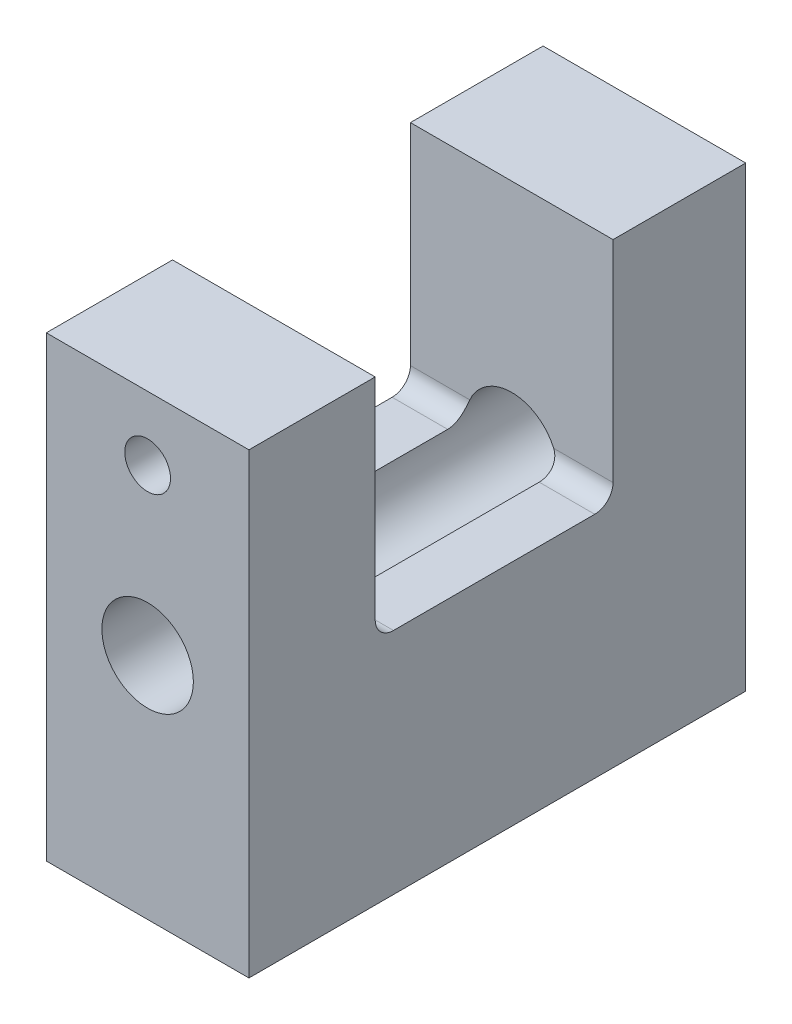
ISO-10303-21;
HEADER;
FILE_DESCRIPTION(('STEP AP214'),'2;1');
FILE_NAME('part.step','',(''),(''),'','','');
FILE_SCHEMA(('AUTOMOTIVE_DESIGN { 1 0 10303 214 1 1 1 1 }'));
ENDSEC;
DATA;
#1=APPLICATION_CONTEXT('core data for automotive mechanical design processes');
#2=APPLICATION_PROTOCOL_DEFINITION('international standard','automotive_design',2000,#1);
#3=PRODUCT_CONTEXT('',#1,'mechanical');
#4=PRODUCT('Part','Part','',(#3));
#5=PRODUCT_RELATED_PRODUCT_CATEGORY('part','',(#4));
#6=PRODUCT_DEFINITION_FORMATION('','',#4);
#7=PRODUCT_DEFINITION_CONTEXT('part definition',#1,'design');
#8=PRODUCT_DEFINITION('design','',#6,#7);
#9=PRODUCT_DEFINITION_SHAPE('','',#8);
#10=(LENGTH_UNIT() NAMED_UNIT(*) SI_UNIT(.MILLI.,.METRE.));
#11=(NAMED_UNIT(*) PLANE_ANGLE_UNIT() SI_UNIT($,.RADIAN.));
#12=(NAMED_UNIT(*) SI_UNIT($,.STERADIAN.) SOLID_ANGLE_UNIT());
#13=UNCERTAINTY_MEASURE_WITH_UNIT(LENGTH_MEASURE(1.E-05),#10,'distance_accuracy_value','');
#14=(GEOMETRIC_REPRESENTATION_CONTEXT(3) GLOBAL_UNCERTAINTY_ASSIGNED_CONTEXT((#13)) GLOBAL_UNIT_ASSIGNED_CONTEXT((#10,
#11,#12)) REPRESENTATION_CONTEXT('',''));
#15=CARTESIAN_POINT('',(0.,0.,0.));
#16=DIRECTION('',(0.,0.,1.));
#17=DIRECTION('',(1.,0.,0.));
#18=AXIS2_PLACEMENT_3D('',#15,#16,#17);
#19=CARTESIAN_POINT('',(-40.,20.,54.3));
#20=DIRECTION('',(0.,-1.,0.));
#21=DIRECTION('',(1.,0.,0.));
#22=AXIS2_PLACEMENT_3D('',#19,#20,#21);
#23=PLANE('',#22);
#24=DIRECTION('',(0.,0.,-1.));
#25=VECTOR('',#24,1.);
#26=CARTESIAN_POINT('',(-17.85,20.,54.3));
#27=LINE('',#26,#25);
#28=CARTESIAN_POINT('',(-17.85,20.,54.3));
#29=VERTEX_POINT('',#28);
#30=CARTESIAN_POINT('',(-17.85,20.,40.5));
#31=VERTEX_POINT('',#30);
#32=EDGE_CURVE('E159',#29,#31,#27,.T.);
#33=ORIENTED_EDGE('',*,*,#32,.T.);
#34=DIRECTION('',(1.,0.,0.));
#35=VECTOR('',#34,1.);
#36=CARTESIAN_POINT('',(-40.,20.,40.5));
#37=LINE('',#36,#35);
#38=CARTESIAN_POINT('',(-40.,20.,40.5));
#39=VERTEX_POINT('',#38);
#40=EDGE_CURVE('E140',#39,#31,#37,.T.);
#41=ORIENTED_EDGE('',*,*,#40,.F.);
#42=DIRECTION('',(0.,0.,-1.));
#43=VECTOR('',#42,1.);
#44=CARTESIAN_POINT('',(-40.,20.,54.3));
#45=LINE('',#44,#43);
#46=CARTESIAN_POINT('',(-40.,20.,54.3));
#47=VERTEX_POINT('',#46);
#48=EDGE_CURVE('E172',#47,#39,#45,.T.);
#49=ORIENTED_EDGE('',*,*,#48,.F.);
#50=DIRECTION('',(-1.,0.,0.));
#51=VECTOR('',#50,1.);
#52=CARTESIAN_POINT('',(-40.,20.,54.3));
#53=LINE('',#52,#51);
#54=EDGE_CURVE('E165',#29,#47,#53,.T.);
#55=ORIENTED_EDGE('',*,*,#54,.F.);
#56=EDGE_LOOP('',(#33,#41,#49,#55));
#57=FACE_BOUND('',#56,.T.);
#58=ADVANCED_FACE('F34',(#57),#23,.F.);
#59=CARTESIAN_POINT('',(-40.,-30.,54.3));
#60=DIRECTION('',(0.,0.,-1.));
#61=DIRECTION('',(-1.,0.,0.));
#62=AXIS2_PLACEMENT_3D('',#59,#60,#61);
#63=PLANE('',#62);
#64=CARTESIAN_POINT('',(-28.925,13.,54.3));
#65=DIRECTION('',(0.,0.,1.));
#66=DIRECTION('',(1.,0.,0.));
#67=AXIS2_PLACEMENT_3D('',#64,#65,#66);
#68=CIRCLE('',#67,2.5);
#69=CARTESIAN_POINT('',(-26.425,13.,54.3));
#70=VERTEX_POINT('',#69);
#71=EDGE_CURVE('E322',#70,#70,#68,.T.);
#72=ORIENTED_EDGE('',*,*,#71,.F.);
#73=EDGE_LOOP('',(#72));
#74=FACE_BOUND('',#73,.T.);
#75=DIRECTION('',(0.,-1.,0.));
#76=VECTOR('',#75,1.);
#77=CARTESIAN_POINT('',(-40.,-30.,54.3));
#78=LINE('',#77,#76);
#79=CARTESIAN_POINT('',(-40.,-30.,54.3));
#80=VERTEX_POINT('',#79);
#81=EDGE_CURVE('E295',#47,#80,#78,.T.);
#82=ORIENTED_EDGE('',*,*,#81,.T.);
#83=DIRECTION('',(1.,0.,0.));
#84=VECTOR('',#83,1.);
#85=CARTESIAN_POINT('',(-40.,-30.,54.3));
#86=LINE('',#85,#84);
#87=CARTESIAN_POINT('',(-17.85,-30.,54.3));
#88=VERTEX_POINT('',#87);
#89=EDGE_CURVE('E291',#80,#88,#86,.T.);
#90=ORIENTED_EDGE('',*,*,#89,.T.);
#91=DIRECTION('',(0.,1.,0.));
#92=VECTOR('',#91,1.);
#93=CARTESIAN_POINT('',(-17.85,-30.,54.3));
#94=LINE('',#93,#92);
#95=EDGE_CURVE('E288',#88,#29,#94,.T.);
#96=ORIENTED_EDGE('',*,*,#95,.T.);
#97=ORIENTED_EDGE('',*,*,#54,.T.);
#98=EDGE_LOOP('',(#82,#90,#96,#97));
#99=FACE_BOUND('',#98,.T.);
#100=CARTESIAN_POINT('',(-28.925,-4.99999999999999,54.3));
#101=DIRECTION('',(0.,0.,1.));
#102=DIRECTION('',(1.,0.,0.));
#103=AXIS2_PLACEMENT_3D('',#100,#101,#102);
#104=CIRCLE('',#103,5.);
#105=CARTESIAN_POINT('',(-23.925,-4.99999999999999,54.3));
#106=VERTEX_POINT('',#105);
#107=EDGE_CURVE('E305',#106,#106,#104,.T.);
#108=ORIENTED_EDGE('',*,*,#107,.F.);
#109=EDGE_LOOP('',(#108));
#110=FACE_BOUND('',#109,.T.);
#111=ADVANCED_FACE('F265',(#74,#99,#110),#63,.F.);
#112=CARTESIAN_POINT('',(-40.,-30.,0.));
#113=DIRECTION('',(0.,0.,-1.));
#114=DIRECTION('',(-1.,0.,0.));
#115=AXIS2_PLACEMENT_3D('',#112,#113,#114);
#116=PLANE('',#115);
#117=CARTESIAN_POINT('',(-28.925,-23.,0.));
#118=DIRECTION('',(0.,0.,-1.));
#119=DIRECTION('',(-1.,0.,0.));
#120=AXIS2_PLACEMENT_3D('',#117,#118,#119);
#121=CIRCLE('',#120,2.5);
#122=CARTESIAN_POINT('',(-31.425,-23.,0.));
#123=VERTEX_POINT('',#122);
#124=EDGE_CURVE('E328',#123,#123,#121,.T.);
#125=ORIENTED_EDGE('',*,*,#124,.F.);
#126=EDGE_LOOP('',(#125));
#127=FACE_BOUND('',#126,.T.);
#128=DIRECTION('',(0.,-1.,0.));
#129=VECTOR('',#128,1.);
#130=CARTESIAN_POINT('',(-40.,-30.,0.));
#131=LINE('',#130,#129);
#132=CARTESIAN_POINT('',(-40.,20.,0.));
#133=VERTEX_POINT('',#132);
#134=CARTESIAN_POINT('',(-40.,-30.,0.));
#135=VERTEX_POINT('',#134);
#136=EDGE_CURVE('E303',#133,#135,#131,.T.);
#137=ORIENTED_EDGE('',*,*,#136,.F.);
#138=DIRECTION('',(-1.,0.,0.));
#139=VECTOR('',#138,1.);
#140=CARTESIAN_POINT('',(-40.,20.,0.));
#141=LINE('',#140,#139);
#142=CARTESIAN_POINT('',(-17.85,20.,0.));
#143=VERTEX_POINT('',#142);
#144=EDGE_CURVE('E285',#143,#133,#141,.T.);
#145=ORIENTED_EDGE('',*,*,#144,.F.);
#146=DIRECTION('',(0.,1.,0.));
#147=VECTOR('',#146,1.);
#148=CARTESIAN_POINT('',(-17.85,-30.,0.));
#149=LINE('',#148,#147);
#150=CARTESIAN_POINT('',(-17.85,-30.,0.));
#151=VERTEX_POINT('',#150);
#152=EDGE_CURVE('E298',#151,#143,#149,.T.);
#153=ORIENTED_EDGE('',*,*,#152,.F.);
#154=DIRECTION('',(1.,0.,0.));
#155=VECTOR('',#154,1.);
#156=CARTESIAN_POINT('',(-40.,-30.,0.));
#157=LINE('',#156,#155);
#158=EDGE_CURVE('E301',#135,#151,#157,.T.);
#159=ORIENTED_EDGE('',*,*,#158,.F.);
#160=EDGE_LOOP('',(#137,#145,#153,#159));
#161=FACE_BOUND('',#160,.T.);
#162=CARTESIAN_POINT('',(-28.925,-4.99999999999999,0.));
#163=DIRECTION('',(0.,0.,1.));
#164=DIRECTION('',(1.,0.,0.));
#165=AXIS2_PLACEMENT_3D('',#162,#163,#164);
#166=CIRCLE('',#165,5.);
#167=CARTESIAN_POINT('',(-23.925,-4.99999999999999,0.));
#168=VERTEX_POINT('',#167);
#169=EDGE_CURVE('E151',#168,#168,#166,.T.);
#170=ORIENTED_EDGE('',*,*,#169,.T.);
#171=EDGE_LOOP('',(#170));
#172=FACE_BOUND('',#171,.T.);
#173=ADVANCED_FACE('F234',(#127,#161,#172),#116,.T.);
#174=CARTESIAN_POINT('',(-40.,-30.,54.3));
#175=DIRECTION('',(1.,0.,0.));
#176=DIRECTION('',(0.,0.,-1.));
#177=AXIS2_PLACEMENT_3D('',#174,#175,#176);
#178=PLANE('',#177);
#179=ORIENTED_EDGE('',*,*,#48,.T.);
#180=DIRECTION('',(0.,-1.,0.));
#181=VECTOR('',#180,1.);
#182=CARTESIAN_POINT('',(-40.,20.,40.5));
#183=LINE('',#182,#181);
#184=CARTESIAN_POINT('',(-40.,-3.,40.5));
#185=VERTEX_POINT('',#184);
#186=EDGE_CURVE('E146',#39,#185,#183,.T.);
#187=ORIENTED_EDGE('',*,*,#186,.T.);
#188=CARTESIAN_POINT('',(-40.,-3.,38.5));
#189=DIRECTION('',(1.,0.,0.));
#190=DIRECTION('',(0.,0.,-1.));
#191=AXIS2_PLACEMENT_3D('',#188,#189,#190);
#192=CIRCLE('',#191,2.);
#193=CARTESIAN_POINT('',(-40.,-5.,38.5));
#194=VERTEX_POINT('',#193);
#195=EDGE_CURVE('E246',#185,#194,#192,.T.);
#196=ORIENTED_EDGE('',*,*,#195,.T.);
#197=DIRECTION('',(0.,0.,-1.));
#198=VECTOR('',#197,1.);
#199=CARTESIAN_POINT('',(-40.,-5.,40.5));
#200=LINE('',#199,#198);
#201=CARTESIAN_POINT('',(-40.,-5.,16.5));
#202=VERTEX_POINT('',#201);
#203=EDGE_CURVE('E313',#194,#202,#200,.T.);
#204=ORIENTED_EDGE('',*,*,#203,.T.);
#205=CARTESIAN_POINT('',(-40.,-3.,16.5));
#206=DIRECTION('',(1.,0.,0.));
#207=DIRECTION('',(0.,0.,-1.));
#208=AXIS2_PLACEMENT_3D('',#205,#206,#207);
#209=CIRCLE('',#208,2.);
#210=CARTESIAN_POINT('',(-40.,-3.,14.5));
#211=VERTEX_POINT('',#210);
#212=EDGE_CURVE('E54',#202,#211,#209,.T.);
#213=ORIENTED_EDGE('',*,*,#212,.T.);
#214=DIRECTION('',(0.,1.,0.));
#215=VECTOR('',#214,1.);
#216=CARTESIAN_POINT('',(-40.,20.,14.5));
#217=LINE('',#216,#215);
#218=CARTESIAN_POINT('',(-40.,20.,14.5));
#219=VERTEX_POINT('',#218);
#220=EDGE_CURVE('E310',#211,#219,#217,.T.);
#221=ORIENTED_EDGE('',*,*,#220,.T.);
#222=EDGE_CURVE('E281',#219,#133,#45,.T.);
#223=ORIENTED_EDGE('',*,*,#222,.T.);
#224=ORIENTED_EDGE('',*,*,#136,.T.);
#225=DIRECTION('',(0.,0.,-1.));
#226=VECTOR('',#225,1.);
#227=CARTESIAN_POINT('',(-40.,-30.,54.3));
#228=LINE('',#227,#226);
#229=EDGE_CURVE('E170',#80,#135,#228,.T.);
#230=ORIENTED_EDGE('',*,*,#229,.F.);
#231=ORIENTED_EDGE('',*,*,#81,.F.);
#232=EDGE_LOOP('',(#179,#187,#196,#204,#213,#221,#223,#224,#230,#231));
#233=FACE_BOUND('',#232,.T.);
#234=ADVANCED_FACE('F36',(#233),#178,.F.);
#235=CARTESIAN_POINT('',(-40.,-30.,54.3));
#236=DIRECTION('',(0.,1.,0.));
#237=DIRECTION('',(-1.,0.,0.));
#238=AXIS2_PLACEMENT_3D('',#235,#236,#237);
#239=PLANE('',#238);
#240=ORIENTED_EDGE('',*,*,#158,.T.);
#241=DIRECTION('',(0.,0.,-1.));
#242=VECTOR('',#241,1.);
#243=CARTESIAN_POINT('',(-17.85,-30.,54.3));
#244=LINE('',#243,#242);
#245=EDGE_CURVE('E166',#88,#151,#244,.T.);
#246=ORIENTED_EDGE('',*,*,#245,.F.);
#247=ORIENTED_EDGE('',*,*,#89,.F.);
#248=ORIENTED_EDGE('',*,*,#229,.T.);
#249=EDGE_LOOP('',(#240,#246,#247,#248));
#250=FACE_BOUND('',#249,.T.);
#251=ADVANCED_FACE('F277',(#250),#239,.F.);
#252=CARTESIAN_POINT('',(-17.85,-30.,54.3));
#253=DIRECTION('',(-1.,0.,0.));
#254=DIRECTION('',(0.,-1.,0.));
#255=AXIS2_PLACEMENT_3D('',#252,#253,#254);
#256=PLANE('',#255);
#257=DIRECTION('',(0.,0.,-1.));
#258=VECTOR('',#257,1.);
#259=CARTESIAN_POINT('',(-17.85,-4.99999999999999,40.5));
#260=LINE('',#259,#258);
#261=CARTESIAN_POINT('',(-17.85,-4.99999999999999,38.5));
#262=VERTEX_POINT('',#261);
#263=CARTESIAN_POINT('',(-17.85,-4.99999999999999,16.5));
#264=VERTEX_POINT('',#263);
#265=EDGE_CURVE('E162',#262,#264,#260,.T.);
#266=ORIENTED_EDGE('',*,*,#265,.F.);
#267=CARTESIAN_POINT('',(-17.85,-2.99999999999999,38.5));
#268=DIRECTION('',(-1.,0.,0.));
#269=DIRECTION('',(0.,-1.,0.));
#270=AXIS2_PLACEMENT_3D('',#267,#268,#269);
#271=CIRCLE('',#270,2.);
#272=CARTESIAN_POINT('',(-17.85,-2.99999999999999,40.5));
#273=VERTEX_POINT('',#272);
#274=EDGE_CURVE('E161',#262,#273,#271,.T.);
#275=ORIENTED_EDGE('',*,*,#274,.T.);
#276=DIRECTION('',(0.,-1.,0.));
#277=VECTOR('',#276,1.);
#278=CARTESIAN_POINT('',(-17.85,20.,40.5));
#279=LINE('',#278,#277);
#280=EDGE_CURVE('E143',#31,#273,#279,.T.);
#281=ORIENTED_EDGE('',*,*,#280,.F.);
#282=ORIENTED_EDGE('',*,*,#32,.F.);
#283=ORIENTED_EDGE('',*,*,#95,.F.);
#284=ORIENTED_EDGE('',*,*,#245,.T.);
#285=ORIENTED_EDGE('',*,*,#152,.T.);
#286=CARTESIAN_POINT('',(-17.85,20.,14.5));
#287=VERTEX_POINT('',#286);
#288=EDGE_CURVE('E167',#287,#143,#27,.T.);
#289=ORIENTED_EDGE('',*,*,#288,.F.);
#290=DIRECTION('',(0.,1.,0.));
#291=VECTOR('',#290,1.);
#292=CARTESIAN_POINT('',(-17.85,20.,14.5));
#293=LINE('',#292,#291);
#294=CARTESIAN_POINT('',(-17.85,-2.99999999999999,14.5));
#295=VERTEX_POINT('',#294);
#296=EDGE_CURVE('E316',#295,#287,#293,.T.);
#297=ORIENTED_EDGE('',*,*,#296,.F.);
#298=CARTESIAN_POINT('',(-17.85,-2.99999999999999,16.5));
#299=DIRECTION('',(-1.,0.,0.));
#300=DIRECTION('',(0.,-1.,0.));
#301=AXIS2_PLACEMENT_3D('',#298,#299,#300);
#302=CIRCLE('',#301,2.);
#303=EDGE_CURVE('E47',#295,#264,#302,.T.);
#304=ORIENTED_EDGE('',*,*,#303,.T.);
#305=EDGE_LOOP('',(#266,#275,#281,#282,#283,#284,#285,#289,#297,#304));
#306=FACE_BOUND('',#305,.T.);
#307=ADVANCED_FACE('F157',(#306),#256,.F.);
#308=ORIENTED_EDGE('',*,*,#222,.F.);
#309=DIRECTION('',(1.,0.,0.));
#310=VECTOR('',#309,1.);
#311=CARTESIAN_POINT('',(-40.,20.,14.5));
#312=LINE('',#311,#310);
#313=EDGE_CURVE('E152',#219,#287,#312,.T.);
#314=ORIENTED_EDGE('',*,*,#313,.T.);
#315=ORIENTED_EDGE('',*,*,#288,.T.);
#316=ORIENTED_EDGE('',*,*,#144,.T.);
#317=EDGE_LOOP('',(#308,#314,#315,#316));
#318=FACE_BOUND('',#317,.T.);
#319=ADVANCED_FACE('F231',(#318),#23,.F.);
#320=CARTESIAN_POINT('',(-28.925,-4.99999999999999,54.3));
#321=DIRECTION('',(0.,0.,-1.));
#322=DIRECTION('',(-1.,0.,0.));
#323=AXIS2_PLACEMENT_3D('',#320,#321,#322);
#324=CYLINDRICAL_SURFACE('',#323,5.);
#325=DIRECTION('',(0.,0.,-1.));
#326=VECTOR('',#325,1.);
#327=CARTESIAN_POINT('',(-33.925,-5.,54.3));
#328=LINE('',#327,#326);
#329=CARTESIAN_POINT('',(-33.925,-5.,38.5));
#330=VERTEX_POINT('',#329);
#331=CARTESIAN_POINT('',(-33.925,-5.,16.5));
#332=VERTEX_POINT('',#331);
#333=EDGE_CURVE('E187',#330,#332,#328,.T.);
#334=ORIENTED_EDGE('',*,*,#333,.F.);
#335=CARTESIAN_POINT('',(-33.925,-5.,38.5));
#336=CARTESIAN_POINT('',(-33.9249945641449,-4.99999961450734,38.5561802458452));
#337=CARTESIAN_POINT('',(-33.9250006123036,-4.99763135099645,38.6123336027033));
#338=CARTESIAN_POINT('',(-33.9249893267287,-4.98818326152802,38.7242401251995));
#339=CARTESIAN_POINT('',(-33.9249719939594,-4.98110362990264,38.7799933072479));
#340=CARTESIAN_POINT('',(-33.9248155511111,-4.9528593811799,38.9459889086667));
#341=CARTESIAN_POINT('',(-33.9245722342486,-4.92468926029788,39.0551225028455));
#342=CARTESIAN_POINT('',(-33.9228992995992,-4.85044875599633,39.2671229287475));
#343=CARTESIAN_POINT('',(-33.921469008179,-4.80436821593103,39.3699861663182));
#344=CARTESIAN_POINT('',(-33.9160237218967,-4.69564281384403,39.5664855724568));
#345=CARTESIAN_POINT('',(-33.9120091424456,-4.63300061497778,39.660123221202));
#346=CARTESIAN_POINT('',(-33.8997701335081,-4.49352695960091,39.8348368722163));
#347=CARTESIAN_POINT('',(-33.8915737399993,-4.41679214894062,39.9159919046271));
#348=CARTESIAN_POINT('',(-33.8693437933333,-4.25139943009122,40.06406744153));
#349=CARTESIAN_POINT('',(-33.8553128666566,-4.16274689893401,40.1309943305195));
#350=CARTESIAN_POINT('',(-33.8205436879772,-3.9791492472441,40.247213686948));
#351=CARTESIAN_POINT('',(-33.7999955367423,-3.88443683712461,40.2969311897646));
#352=CARTESIAN_POINT('',(-33.7513592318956,-3.68992600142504,40.3802119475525));
#353=CARTESIAN_POINT('',(-33.7232675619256,-3.59012522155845,40.4137676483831));
#354=CARTESIAN_POINT('',(-33.6655118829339,-3.40786303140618,40.4597832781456));
#355=CARTESIAN_POINT('',(-33.6371425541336,-3.32567951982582,40.4750275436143));
#356=CARTESIAN_POINT('',(-33.5910878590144,-3.20290872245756,40.4901074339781));
#357=CARTESIAN_POINT('',(-33.5751655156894,-3.16209829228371,40.4938364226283));
#358=CARTESIAN_POINT('',(-33.5421996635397,-3.08078278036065,40.4987828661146));
#359=CARTESIAN_POINT('',(-33.5251562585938,-3.04027767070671,40.500000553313));
#360=CARTESIAN_POINT('',(-33.5075756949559,-3.,40.5));
#361=B_SPLINE_CURVE_WITH_KNOTS('',3,(#335,#336,#337,#338,#339,#340,#341,#342,#343,#344,#345,
#346,#347,#348,#349,#350,#351,#352,#353,#354,#355,#356,#357,#358,#359,#360),.UNSPECIFIED.,.F.,
.F.,(4,2,2,2,2,2,2,2,2,2,2,2,4),(0.,0.168437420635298,0.33686789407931,0.673269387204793,
1.00986192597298,1.346400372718,1.68071165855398,2.01487261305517,2.34006609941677,
2.66541143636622,2.92942559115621,3.06124371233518,3.19304963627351),.UNSPECIFIED.);
#362=CARTESIAN_POINT('',(-33.5075756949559,-3.,40.5));
#363=VERTEX_POINT('',#362);
#364=EDGE_CURVE('E216',#330,#363,#361,.T.);
#365=ORIENTED_EDGE('',*,*,#364,.T.);
#366=CARTESIAN_POINT('',(-28.925,-4.99999999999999,40.5));
#367=DIRECTION('',(0.,0.,1.));
#368=DIRECTION('',(1.,0.,0.));
#369=AXIS2_PLACEMENT_3D('',#366,#367,#368);
#370=CIRCLE('',#369,5.);
#371=CARTESIAN_POINT('',(-24.3424243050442,-2.99999999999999,40.5));
#372=VERTEX_POINT('',#371);
#373=EDGE_CURVE('E184',#372,#363,#370,.T.);
#374=ORIENTED_EDGE('',*,*,#373,.F.);
#375=CARTESIAN_POINT('',(-24.3424243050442,-2.99999999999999,40.5));
#376=CARTESIAN_POINT('',(-24.3200810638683,-3.05117577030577,40.5000055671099));
#377=CARTESIAN_POINT('',(-24.2986051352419,-3.10274067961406,40.4980354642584));
#378=CARTESIAN_POINT('',(-24.2574808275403,-3.20630255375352,40.4900082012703));
#379=CARTESIAN_POINT('',(-24.2378332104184,-3.25829968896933,40.4839493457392));
#380=CARTESIAN_POINT('',(-24.2004674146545,-3.36236385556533,40.4676043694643));
#381=CARTESIAN_POINT('',(-24.1827502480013,-3.41443090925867,40.45731604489));
#382=CARTESIAN_POINT('',(-24.1493199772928,-3.51815767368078,40.4324498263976));
#383=CARTESIAN_POINT('',(-24.1336065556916,-3.56981744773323,40.4178726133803));
#384=CARTESIAN_POINT('',(-24.0894248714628,-3.7238404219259,40.3675397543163));
#385=CARTESIAN_POINT('',(-24.063990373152,-3.8250352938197,40.3252151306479));
#386=CARTESIAN_POINT('',(-24.0209177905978,-4.02020686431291,40.2237398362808));
#387=CARTESIAN_POINT('',(-24.0032717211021,-4.11419087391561,40.1646065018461));
#388=CARTESIAN_POINT('',(-23.9751757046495,-4.28816669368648,40.0336269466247));
#389=CARTESIAN_POINT('',(-23.9644698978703,-4.36856358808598,39.9623725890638));
#390=CARTESIAN_POINT('',(-23.9478057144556,-4.51715008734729,39.8075834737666));
#391=CARTESIAN_POINT('',(-23.9418496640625,-4.58533369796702,39.7240427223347));
#392=CARTESIAN_POINT('',(-23.9331305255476,-4.70828058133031,39.5457826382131));
#393=CARTESIAN_POINT('',(-23.9304119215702,-4.76284891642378,39.4509268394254));
#394=CARTESIAN_POINT('',(-23.9268620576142,-4.85580259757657,39.2535851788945));
#395=CARTESIAN_POINT('',(-23.9260304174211,-4.89419120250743,39.1511008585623));
#396=CARTESIAN_POINT('',(-23.925195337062,-4.94916831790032,38.9574431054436));
#397=CARTESIAN_POINT('',(-23.9250839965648,-4.96820502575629,38.8669611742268));
#398=CARTESIAN_POINT('',(-23.9250126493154,-4.98726689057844,38.7299971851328));
#399=CARTESIAN_POINT('',(-23.9250048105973,-4.99203864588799,38.6841359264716));
#400=CARTESIAN_POINT('',(-23.9249997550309,-4.99840561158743,38.5921874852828));
#401=CARTESIAN_POINT('',(-23.9250025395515,-5.00000041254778,38.5461002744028));
#402=CARTESIAN_POINT('',(-23.925,-4.99999999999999,38.5));
#403=B_SPLINE_CURVE_WITH_KNOTS('',3,(#375,#376,#377,#378,#379,#380,#381,#382,#383,#384,#385,
#386,#387,#388,#389,#390,#391,#392,#393,#394,#395,#396,#397,#398,#399,#400,#401,#402),
.UNSPECIFIED.,.F.,.F.,(4,2,2,2,2,2,2,2,2,2,2,2,2,4),(0.,0.167492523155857,0.335054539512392,
0.502703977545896,0.670326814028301,1.00624515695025,1.34181828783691,1.66418569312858,
1.98671088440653,2.31361840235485,2.64046004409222,2.91692195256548,3.05515140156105,
3.19339866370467),.UNSPECIFIED.);
#404=CARTESIAN_POINT('',(-23.925,-4.99999999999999,38.5));
#405=VERTEX_POINT('',#404);
#406=EDGE_CURVE('E210',#372,#405,#403,.T.);
#407=ORIENTED_EDGE('',*,*,#406,.T.);
#408=DIRECTION('',(0.,0.,-1.));
#409=VECTOR('',#408,1.);
#410=CARTESIAN_POINT('',(-23.925,-4.99999999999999,54.3));
#411=LINE('',#410,#409);
#412=CARTESIAN_POINT('',(-23.925,-4.99999999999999,16.5));
#413=VERTEX_POINT('',#412);
#414=EDGE_CURVE('E178',#413,#405,#411,.F.);
#415=ORIENTED_EDGE('',*,*,#414,.F.);
#416=CARTESIAN_POINT('',(-23.925,-4.99999999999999,16.5));
#417=CARTESIAN_POINT('',(-23.9250054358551,-4.99999961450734,16.4438197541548));
#418=CARTESIAN_POINT('',(-23.9249993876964,-4.99763135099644,16.3876663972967));
#419=CARTESIAN_POINT('',(-23.9250106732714,-4.98818326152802,16.2757598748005));
#420=CARTESIAN_POINT('',(-23.9250280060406,-4.98110362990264,16.220006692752));
#421=CARTESIAN_POINT('',(-23.925184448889,-4.95285938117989,16.0540110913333));
#422=CARTESIAN_POINT('',(-23.9254277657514,-4.92468926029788,15.9448774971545));
#423=CARTESIAN_POINT('',(-23.9271007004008,-4.85044875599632,15.7328770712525));
#424=CARTESIAN_POINT('',(-23.928530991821,-4.80436821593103,15.6300138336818));
#425=CARTESIAN_POINT('',(-23.9339762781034,-4.69564281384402,15.4335144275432));
#426=CARTESIAN_POINT('',(-23.9379908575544,-4.63300061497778,15.339876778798));
#427=CARTESIAN_POINT('',(-23.9502298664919,-4.49352695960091,15.1651631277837));
#428=CARTESIAN_POINT('',(-23.9584262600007,-4.41679214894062,15.0840080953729));
#429=CARTESIAN_POINT('',(-23.9806562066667,-4.25139943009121,14.93593255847));
#430=CARTESIAN_POINT('',(-23.9946871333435,-4.16274689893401,14.8690056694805));
#431=CARTESIAN_POINT('',(-24.0294563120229,-3.97914924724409,14.752786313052));
#432=CARTESIAN_POINT('',(-24.0500044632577,-3.88443683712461,14.7030688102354));
#433=CARTESIAN_POINT('',(-24.0986407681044,-3.68992600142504,14.6197880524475));
#434=CARTESIAN_POINT('',(-24.1267324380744,-3.59012522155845,14.5862323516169));
#435=CARTESIAN_POINT('',(-24.1844881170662,-3.40786303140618,14.5402167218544));
#436=CARTESIAN_POINT('',(-24.2128574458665,-3.32567951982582,14.5249724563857));
#437=CARTESIAN_POINT('',(-24.2589121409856,-3.20290872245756,14.5098925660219));
#438=CARTESIAN_POINT('',(-24.2748344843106,-3.16209829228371,14.5061635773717));
#439=CARTESIAN_POINT('',(-24.3078003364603,-3.08078278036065,14.5012171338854));
#440=CARTESIAN_POINT('',(-24.3248437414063,-3.04027767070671,14.499999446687));
#441=CARTESIAN_POINT('',(-24.3424243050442,-2.99999999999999,14.5));
#442=B_SPLINE_CURVE_WITH_KNOTS('',3,(#416,#417,#418,#419,#420,#421,#422,#423,#424,#425,#426,
#427,#428,#429,#430,#431,#432,#433,#434,#435,#436,#437,#438,#439,#440,#441),.UNSPECIFIED.,.F.,
.F.,(4,2,2,2,2,2,2,2,2,2,2,2,4),(0.,0.168437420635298,0.33686789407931,0.673269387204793,
1.00986192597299,1.346400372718,1.68071165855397,2.01487261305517,2.34006609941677,
2.66541143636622,2.92942559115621,3.06124371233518,3.19304963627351),.UNSPECIFIED.);
#443=CARTESIAN_POINT('',(-24.3424243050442,-2.99999999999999,14.5));
#444=VERTEX_POINT('',#443);
#445=EDGE_CURVE('E11',#413,#444,#442,.T.);
#446=ORIENTED_EDGE('',*,*,#445,.T.);
#447=CARTESIAN_POINT('',(-28.925,-4.99999999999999,14.5));
#448=DIRECTION('',(0.,0.,-1.));
#449=DIRECTION('',(-1.,0.,0.));
#450=AXIS2_PLACEMENT_3D('',#447,#448,#449);
#451=CIRCLE('',#450,5.);
#452=CARTESIAN_POINT('',(-33.5075756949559,-3.,14.5));
#453=VERTEX_POINT('',#452);
#454=EDGE_CURVE('E181',#453,#444,#451,.T.);
#455=ORIENTED_EDGE('',*,*,#454,.F.);
#456=CARTESIAN_POINT('',(-33.5075756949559,-3.,14.5));
#457=CARTESIAN_POINT('',(-33.5299189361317,-3.05117577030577,14.4999944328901));
#458=CARTESIAN_POINT('',(-33.5513948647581,-3.10274067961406,14.5019645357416));
#459=CARTESIAN_POINT('',(-33.5925191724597,-3.20630255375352,14.5099917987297));
#460=CARTESIAN_POINT('',(-33.6121667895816,-3.25829968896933,14.5160506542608));
#461=CARTESIAN_POINT('',(-33.6495325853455,-3.36236385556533,14.5323956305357));
#462=CARTESIAN_POINT('',(-33.6672497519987,-3.41443090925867,14.54268395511));
#463=CARTESIAN_POINT('',(-33.7006800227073,-3.51815767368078,14.5675501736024));
#464=CARTESIAN_POINT('',(-33.7163934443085,-3.56981744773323,14.5821273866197));
#465=CARTESIAN_POINT('',(-33.7605751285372,-3.7238404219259,14.6324602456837));
#466=CARTESIAN_POINT('',(-33.7860096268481,-3.8250352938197,14.6747848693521));
#467=CARTESIAN_POINT('',(-33.8290822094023,-4.02020686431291,14.7762601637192));
#468=CARTESIAN_POINT('',(-33.846728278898,-4.11419087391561,14.8353934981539));
#469=CARTESIAN_POINT('',(-33.8748242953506,-4.28816669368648,14.9663730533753));
#470=CARTESIAN_POINT('',(-33.8855301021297,-4.36856358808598,15.0376274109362));
#471=CARTESIAN_POINT('',(-33.9021942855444,-4.5171500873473,15.1924165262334));
#472=CARTESIAN_POINT('',(-33.9081503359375,-4.58533369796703,15.2759572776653));
#473=CARTESIAN_POINT('',(-33.9168694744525,-4.70828058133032,15.4542173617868));
#474=CARTESIAN_POINT('',(-33.9195880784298,-4.76284891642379,15.5490731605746));
#475=CARTESIAN_POINT('',(-33.9231379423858,-4.85580259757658,15.7464148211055));
#476=CARTESIAN_POINT('',(-33.9239695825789,-4.89419120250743,15.8488991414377));
#477=CARTESIAN_POINT('',(-33.9248046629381,-4.94916831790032,16.0425568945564));
#478=CARTESIAN_POINT('',(-33.9249160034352,-4.96820502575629,16.1330388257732));
#479=CARTESIAN_POINT('',(-33.9249873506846,-4.98726689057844,16.2700028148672));
#480=CARTESIAN_POINT('',(-33.9249951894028,-4.99203864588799,16.3158640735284));
#481=CARTESIAN_POINT('',(-33.9250002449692,-4.99840561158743,16.4078125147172));
#482=CARTESIAN_POINT('',(-33.9249974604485,-5.00000041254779,16.4538997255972));
#483=CARTESIAN_POINT('',(-33.925,-5.,16.5));
#484=B_SPLINE_CURVE_WITH_KNOTS('',3,(#456,#457,#458,#459,#460,#461,#462,#463,#464,#465,#466,
#467,#468,#469,#470,#471,#472,#473,#474,#475,#476,#477,#478,#479,#480,#481,#482,#483),
.UNSPECIFIED.,.F.,.F.,(4,2,2,2,2,2,2,2,2,2,2,2,2,4),(0.,0.167492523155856,0.33505453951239,
0.502703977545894,0.670326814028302,1.00624515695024,1.34181828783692,1.66418569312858,
1.98671088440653,2.31361840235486,2.64046004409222,2.91692195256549,3.05515140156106,
3.19339866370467),.UNSPECIFIED.);
#485=EDGE_CURVE('E240',#453,#332,#484,.T.);
#486=ORIENTED_EDGE('',*,*,#485,.T.);
#487=EDGE_LOOP('',(#334,#365,#374,#407,#415,#446,#455,#486));
#488=FACE_BOUND('',#487,.T.);
#489=ORIENTED_EDGE('',*,*,#107,.T.);
#490=EDGE_LOOP('',(#489));
#491=FACE_BOUND('',#490,.T.);
#492=ORIENTED_EDGE('',*,*,#169,.F.);
#493=EDGE_LOOP('',(#492));
#494=FACE_BOUND('',#493,.T.);
#495=ADVANCED_FACE('F225',(#488,#491,#494),#324,.F.);
#496=CARTESIAN_POINT('',(-40.,-5.,40.5));
#497=DIRECTION('',(0.,-1.,0.));
#498=DIRECTION('',(1.,0.,0.));
#499=AXIS2_PLACEMENT_3D('',#496,#497,#498);
#500=PLANE('',#499);
#501=ORIENTED_EDGE('',*,*,#203,.F.);
#502=DIRECTION('',(1.,0.,0.));
#503=VECTOR('',#502,1.);
#504=CARTESIAN_POINT('',(-33.925,-5.,38.5));
#505=LINE('',#504,#503);
#506=EDGE_CURVE('E201',#194,#330,#505,.T.);
#507=ORIENTED_EDGE('',*,*,#506,.T.);
#508=ORIENTED_EDGE('',*,*,#333,.T.);
#509=DIRECTION('',(1.,0.,0.));
#510=VECTOR('',#509,1.);
#511=CARTESIAN_POINT('',(-40.,-5.,16.5));
#512=LINE('',#511,#510);
#513=EDGE_CURVE('E199',#332,#202,#512,.F.);
#514=ORIENTED_EDGE('',*,*,#513,.T.);
#515=EDGE_LOOP('',(#501,#507,#508,#514));
#516=FACE_BOUND('',#515,.T.);
#517=ADVANCED_FACE('F230',(#516),#500,.F.);
#518=CARTESIAN_POINT('',(-40.,20.,40.5));
#519=DIRECTION('',(0.,0.,1.));
#520=DIRECTION('',(1.,0.,0.));
#521=AXIS2_PLACEMENT_3D('',#518,#519,#520);
#522=PLANE('',#521);
#523=ORIENTED_EDGE('',*,*,#280,.T.);
#524=DIRECTION('',(1.,0.,0.));
#525=VECTOR('',#524,1.);
#526=CARTESIAN_POINT('',(-23.925,-2.99999999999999,40.5));
#527=LINE('',#526,#525);
#528=EDGE_CURVE('E197',#273,#372,#527,.F.);
#529=ORIENTED_EDGE('',*,*,#528,.T.);
#530=ORIENTED_EDGE('',*,*,#373,.T.);
#531=DIRECTION('',(1.,0.,0.));
#532=VECTOR('',#531,1.);
#533=CARTESIAN_POINT('',(-40.,-3.,40.5));
#534=LINE('',#533,#532);
#535=EDGE_CURVE('E195',#363,#185,#534,.F.);
#536=ORIENTED_EDGE('',*,*,#535,.T.);
#537=ORIENTED_EDGE('',*,*,#186,.F.);
#538=ORIENTED_EDGE('',*,*,#40,.T.);
#539=EDGE_LOOP('',(#523,#529,#530,#536,#537,#538));
#540=FACE_BOUND('',#539,.T.);
#541=ADVANCED_FACE('F142',(#540),#522,.F.);
#542=CARTESIAN_POINT('',(-40.,20.,14.5));
#543=DIRECTION('',(0.,0.,-1.));
#544=DIRECTION('',(-1.,0.,0.));
#545=AXIS2_PLACEMENT_3D('',#542,#543,#544);
#546=PLANE('',#545);
#547=ORIENTED_EDGE('',*,*,#220,.F.);
#548=DIRECTION('',(1.,0.,0.));
#549=VECTOR('',#548,1.);
#550=CARTESIAN_POINT('',(-33.925,-3.,14.5));
#551=LINE('',#550,#549);
#552=EDGE_CURVE('E206',#211,#453,#551,.T.);
#553=ORIENTED_EDGE('',*,*,#552,.T.);
#554=ORIENTED_EDGE('',*,*,#454,.T.);
#555=DIRECTION('',(1.,0.,0.));
#556=VECTOR('',#555,1.);
#557=CARTESIAN_POINT('',(-17.85,-2.99999999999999,14.5));
#558=LINE('',#557,#556);
#559=EDGE_CURVE('E204',#444,#295,#558,.T.);
#560=ORIENTED_EDGE('',*,*,#559,.T.);
#561=ORIENTED_EDGE('',*,*,#296,.T.);
#562=ORIENTED_EDGE('',*,*,#313,.F.);
#563=EDGE_LOOP('',(#547,#553,#554,#560,#561,#562));
#564=FACE_BOUND('',#563,.T.);
#565=ADVANCED_FACE('F349',(#564),#546,.F.);
#566=ORIENTED_EDGE('',*,*,#414,.T.);
#567=DIRECTION('',(1.,0.,0.));
#568=VECTOR('',#567,1.);
#569=CARTESIAN_POINT('',(-17.85,-4.99999999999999,38.5));
#570=LINE('',#569,#568);
#571=EDGE_CURVE('E192',#405,#262,#570,.T.);
#572=ORIENTED_EDGE('',*,*,#571,.T.);
#573=ORIENTED_EDGE('',*,*,#265,.T.);
#574=DIRECTION('',(1.,0.,0.));
#575=VECTOR('',#574,1.);
#576=CARTESIAN_POINT('',(-23.925,-4.99999999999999,16.5));
#577=LINE('',#576,#575);
#578=EDGE_CURVE('E190',#264,#413,#577,.F.);
#579=ORIENTED_EDGE('',*,*,#578,.T.);
#580=EDGE_LOOP('',(#566,#572,#573,#579));
#581=FACE_BOUND('',#580,.T.);
#582=ADVANCED_FACE('F261',(#581),#500,.F.);
#583=CARTESIAN_POINT('',(-40.,-3.,38.5));
#584=DIRECTION('',(-1.,0.,0.));
#585=DIRECTION('',(0.,-1.,0.));
#586=AXIS2_PLACEMENT_3D('',#583,#584,#585);
#587=CYLINDRICAL_SURFACE('',#586,2.);
#588=ORIENTED_EDGE('',*,*,#406,.F.);
#589=ORIENTED_EDGE('',*,*,#528,.F.);
#590=ORIENTED_EDGE('',*,*,#274,.F.);
#591=ORIENTED_EDGE('',*,*,#571,.F.);
#592=EDGE_LOOP('',(#588,#589,#590,#591));
#593=FACE_BOUND('',#592,.T.);
#594=ADVANCED_FACE('F222',(#593),#587,.F.);
#595=CARTESIAN_POINT('',(-40.,-3.,38.5));
#596=DIRECTION('',(-1.,0.,0.));
#597=DIRECTION('',(0.,-1.,0.));
#598=AXIS2_PLACEMENT_3D('',#595,#596,#597);
#599=CYLINDRICAL_SURFACE('',#598,2.);
#600=ORIENTED_EDGE('',*,*,#195,.F.);
#601=ORIENTED_EDGE('',*,*,#535,.F.);
#602=ORIENTED_EDGE('',*,*,#364,.F.);
#603=ORIENTED_EDGE('',*,*,#506,.F.);
#604=EDGE_LOOP('',(#600,#601,#602,#603));
#605=FACE_BOUND('',#604,.T.);
#606=ADVANCED_FACE('F251',(#605),#599,.F.);
#607=CARTESIAN_POINT('',(-40.,-3.,16.5));
#608=DIRECTION('',(-1.,0.,0.));
#609=DIRECTION('',(0.,-1.,0.));
#610=AXIS2_PLACEMENT_3D('',#607,#608,#609);
#611=CYLINDRICAL_SURFACE('',#610,2.);
#612=ORIENTED_EDGE('',*,*,#212,.F.);
#613=ORIENTED_EDGE('',*,*,#513,.F.);
#614=ORIENTED_EDGE('',*,*,#485,.F.);
#615=ORIENTED_EDGE('',*,*,#552,.F.);
#616=EDGE_LOOP('',(#612,#613,#614,#615));
#617=FACE_BOUND('',#616,.T.);
#618=ADVANCED_FACE('F247',(#617),#611,.F.);
#619=CARTESIAN_POINT('',(-40.,-3.,16.5));
#620=DIRECTION('',(-1.,0.,0.));
#621=DIRECTION('',(0.,-1.,0.));
#622=AXIS2_PLACEMENT_3D('',#619,#620,#621);
#623=CYLINDRICAL_SURFACE('',#622,2.);
#624=ORIENTED_EDGE('',*,*,#445,.F.);
#625=ORIENTED_EDGE('',*,*,#578,.F.);
#626=ORIENTED_EDGE('',*,*,#303,.F.);
#627=ORIENTED_EDGE('',*,*,#559,.F.);
#628=EDGE_LOOP('',(#624,#625,#626,#627));
#629=FACE_BOUND('',#628,.T.);
#630=ADVANCED_FACE('F250',(#629),#623,.F.);
#631=CARTESIAN_POINT('',(-28.925,13.,46.3));
#632=DIRECTION('',(0.,0.,1.));
#633=DIRECTION('',(1.,0.,0.));
#634=AXIS2_PLACEMENT_3D('',#631,#632,#633);
#635=CYLINDRICAL_SURFACE('',#634,2.5);
#636=CARTESIAN_POINT('',(-28.925,13.,46.3));
#637=DIRECTION('',(0.,0.,1.));
#638=DIRECTION('',(1.,0.,0.));
#639=AXIS2_PLACEMENT_3D('',#636,#637,#638);
#640=CIRCLE('',#639,2.5);
#641=CARTESIAN_POINT('',(-26.425,13.,46.3));
#642=VERTEX_POINT('',#641);
#643=EDGE_CURVE('E163',#642,#642,#640,.T.);
#644=ORIENTED_EDGE('',*,*,#643,.F.);
#645=EDGE_LOOP('',(#644));
#646=FACE_BOUND('',#645,.T.);
#647=ORIENTED_EDGE('',*,*,#71,.T.);
#648=EDGE_LOOP('',(#647));
#649=FACE_BOUND('',#648,.T.);
#650=ADVANCED_FACE('F454',(#646,#649),#635,.F.);
#651=CARTESIAN_POINT('',(-28.925,13.,46.3));
#652=DIRECTION('',(0.,0.,1.));
#653=DIRECTION('',(1.,0.,0.));
#654=AXIS2_PLACEMENT_3D('',#651,#652,#653);
#655=PLANE('',#654);
#656=ORIENTED_EDGE('',*,*,#643,.T.);
#657=EDGE_LOOP('',(#656));
#658=FACE_BOUND('',#657,.T.);
#659=ADVANCED_FACE('F462',(#658),#655,.T.);
#660=CARTESIAN_POINT('',(-28.925,-23.,8.));
#661=DIRECTION('',(0.,0.,-1.));
#662=DIRECTION('',(-1.,0.,0.));
#663=AXIS2_PLACEMENT_3D('',#660,#661,#662);
#664=CYLINDRICAL_SURFACE('',#663,2.5);
#665=CARTESIAN_POINT('',(-28.925,-23.,8.));
#666=DIRECTION('',(0.,0.,-1.));
#667=DIRECTION('',(-1.,0.,0.));
#668=AXIS2_PLACEMENT_3D('',#665,#666,#667);
#669=CIRCLE('',#668,2.5);
#670=CARTESIAN_POINT('',(-31.425,-23.,8.));
#671=VERTEX_POINT('',#670);
#672=EDGE_CURVE('E325',#671,#671,#669,.T.);
#673=ORIENTED_EDGE('',*,*,#672,.F.);
#674=EDGE_LOOP('',(#673));
#675=FACE_BOUND('',#674,.T.);
#676=ORIENTED_EDGE('',*,*,#124,.T.);
#677=EDGE_LOOP('',(#676));
#678=FACE_BOUND('',#677,.T.);
#679=ADVANCED_FACE('F332',(#675,#678),#664,.F.);
#680=CARTESIAN_POINT('',(-28.925,-23.,8.));
#681=DIRECTION('',(0.,0.,-1.));
#682=DIRECTION('',(-1.,0.,0.));
#683=AXIS2_PLACEMENT_3D('',#680,#681,#682);
#684=PLANE('',#683);
#685=ORIENTED_EDGE('',*,*,#672,.T.);
#686=EDGE_LOOP('',(#685));
#687=FACE_BOUND('',#686,.T.);
#688=ADVANCED_FACE('F480',(#687),#684,.T.);
#689=CLOSED_SHELL('',(#58,#111,#173,#234,#251,#307,#319,#495,#517,#541,#565,#582,#594,#606,#618,
#630,#650,#659,#679,#688));
#690=MANIFOLD_SOLID_BREP('B2',#689);
#691=ADVANCED_BREP_SHAPE_REPRESENTATION('',(#18,#690),#14);
#692=SHAPE_DEFINITION_REPRESENTATION(#9,#691);
ENDSEC;
END-ISO-10303-21;
